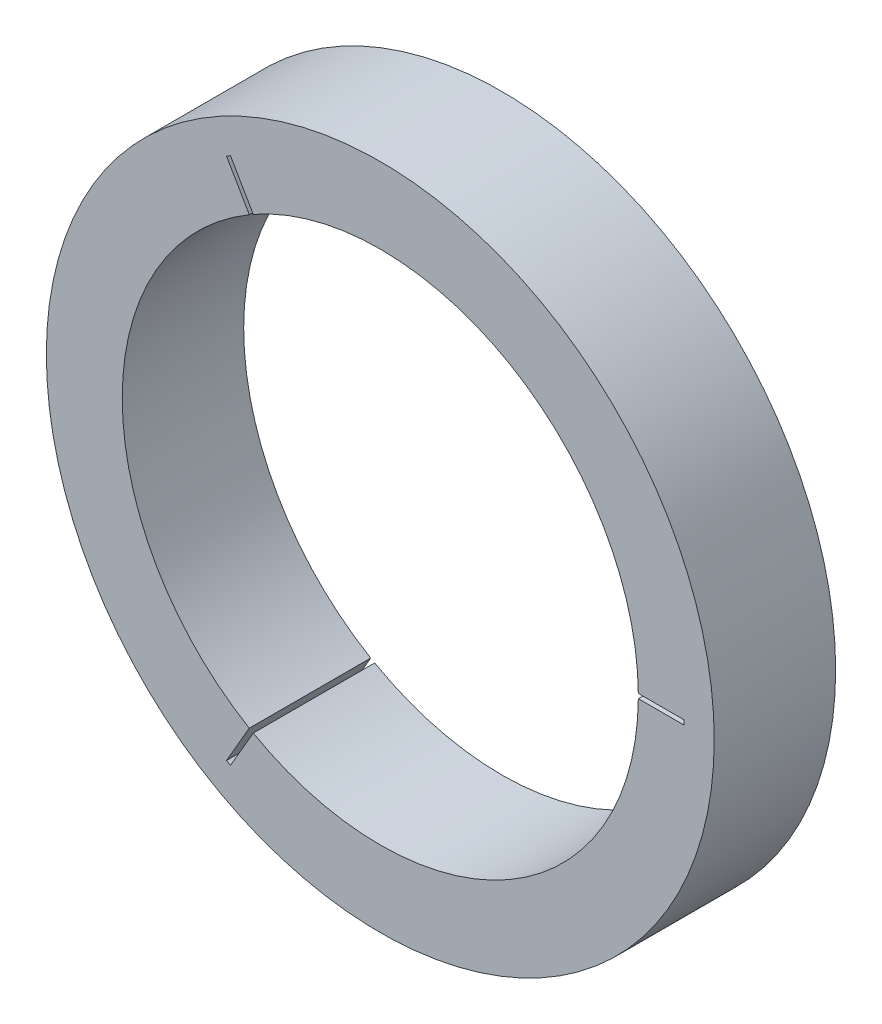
ISO-10303-21;
HEADER;
FILE_DESCRIPTION(('STEP AP214'),'2;1');
FILE_NAME('part.step','',(''),(''),'','','');
FILE_SCHEMA(('AUTOMOTIVE_DESIGN { 1 0 10303 214 1 1 1 1 }'));
ENDSEC;
DATA;
#1=APPLICATION_CONTEXT('core data for automotive mechanical design processes');
#2=APPLICATION_PROTOCOL_DEFINITION('international standard','automotive_design',2000,#1);
#3=PRODUCT_CONTEXT('',#1,'mechanical');
#4=PRODUCT('Part','Part','',(#3));
#5=PRODUCT_RELATED_PRODUCT_CATEGORY('part','',(#4));
#6=PRODUCT_DEFINITION_FORMATION('','',#4);
#7=PRODUCT_DEFINITION_CONTEXT('part definition',#1,'design');
#8=PRODUCT_DEFINITION('design','',#6,#7);
#9=PRODUCT_DEFINITION_SHAPE('','',#8);
#10=(LENGTH_UNIT() NAMED_UNIT(*) SI_UNIT(.MILLI.,.METRE.));
#11=(NAMED_UNIT(*) PLANE_ANGLE_UNIT() SI_UNIT($,.RADIAN.));
#12=(NAMED_UNIT(*) SI_UNIT($,.STERADIAN.) SOLID_ANGLE_UNIT());
#13=UNCERTAINTY_MEASURE_WITH_UNIT(LENGTH_MEASURE(1.E-05),#10,'distance_accuracy_value','');
#14=(GEOMETRIC_REPRESENTATION_CONTEXT(3) GLOBAL_UNCERTAINTY_ASSIGNED_CONTEXT((#13)) GLOBAL_UNIT_ASSIGNED_CONTEXT((#10,
#11,#12)) REPRESENTATION_CONTEXT('',''));
#15=CARTESIAN_POINT('',(0.,0.,0.));
#16=DIRECTION('',(0.,0.,1.));
#17=DIRECTION('',(1.,0.,0.));
#18=AXIS2_PLACEMENT_3D('',#15,#16,#17);
#19=CARTESIAN_POINT('',(0.,0.,0.));
#20=DIRECTION('',(0.,0.,1.));
#21=DIRECTION('',(1.,0.,0.));
#22=AXIS2_PLACEMENT_3D('',#19,#20,#21);
#23=CYLINDRICAL_SURFACE('',#22,85.);
#24=CARTESIAN_POINT('',(0.,0.,0.));
#25=DIRECTION('',(0.,0.,1.));
#26=DIRECTION('',(1.,0.,0.));
#27=AXIS2_PLACEMENT_3D('',#24,#25,#26);
#28=CIRCLE('',#27,85.);
#29=CARTESIAN_POINT('',(-43.1478646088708,73.2342937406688,0.));
#30=VERTEX_POINT('',#29);
#31=CARTESIAN_POINT('',(-43.1478646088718,-73.2342937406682,0.));
#32=VERTEX_POINT('',#31);
#33=EDGE_CURVE('E64',#30,#32,#28,.T.);
#34=ORIENTED_EDGE('',*,*,#33,.F.);
#35=DIRECTION('',(0.,0.,1.));
#36=VECTOR('',#35,1.);
#37=CARTESIAN_POINT('',(-43.1478646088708,73.2342937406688,0.));
#38=LINE('',#37,#36);
#39=CARTESIAN_POINT('',(-43.1478646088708,73.2342937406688,40.));
#40=VERTEX_POINT('',#39);
#41=EDGE_CURVE('E11',#30,#40,#38,.T.);
#42=ORIENTED_EDGE('',*,*,#41,.T.);
#43=CARTESIAN_POINT('',(0.,0.,40.));
#44=DIRECTION('',(0.,0.,1.));
#45=DIRECTION('',(1.,0.,0.));
#46=AXIS2_PLACEMENT_3D('',#43,#44,#45);
#47=CIRCLE('',#46,85.);
#48=CARTESIAN_POINT('',(-43.1478646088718,-73.2342937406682,40.));
#49=VERTEX_POINT('',#48);
#50=EDGE_CURVE('E206',#40,#49,#47,.T.);
#51=ORIENTED_EDGE('',*,*,#50,.T.);
#52=DIRECTION('',(0.,0.,1.));
#53=VECTOR('',#52,1.);
#54=CARTESIAN_POINT('',(-43.1478646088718,-73.2342937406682,0.));
#55=LINE('',#54,#53);
#56=EDGE_CURVE('E222',#49,#32,#55,.F.);
#57=ORIENTED_EDGE('',*,*,#56,.T.);
#58=EDGE_LOOP('',(#34,#42,#51,#57));
#59=FACE_BOUND('',#58,.T.);
#60=ADVANCED_FACE('F41',(#59),#23,.F.);
#61=CARTESIAN_POINT('',(-41.8488265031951,-73.9842937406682,0.));
#62=VERTEX_POINT('',#61);
#63=CARTESIAN_POINT('',(84.9966911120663,-0.750000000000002,0.));
#64=VERTEX_POINT('',#63);
#65=EDGE_CURVE('E205',#62,#64,#28,.T.);
#66=ORIENTED_EDGE('',*,*,#65,.F.);
#67=DIRECTION('',(0.,0.,1.));
#68=VECTOR('',#67,1.);
#69=CARTESIAN_POINT('',(-41.8488265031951,-73.9842937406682,0.));
#70=LINE('',#69,#68);
#71=CARTESIAN_POINT('',(-41.8488265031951,-73.9842937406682,40.));
#72=VERTEX_POINT('',#71);
#73=EDGE_CURVE('E225',#62,#72,#70,.T.);
#74=ORIENTED_EDGE('',*,*,#73,.T.);
#75=CARTESIAN_POINT('',(84.9966911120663,-0.750000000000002,40.));
#76=VERTEX_POINT('',#75);
#77=EDGE_CURVE('E200',#72,#76,#47,.T.);
#78=ORIENTED_EDGE('',*,*,#77,.T.);
#79=DIRECTION('',(0.,0.,1.));
#80=VECTOR('',#79,1.);
#81=CARTESIAN_POINT('',(84.9966911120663,-0.750000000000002,0.));
#82=LINE('',#81,#80);
#83=EDGE_CURVE('E216',#76,#64,#82,.F.);
#84=ORIENTED_EDGE('',*,*,#83,.T.);
#85=EDGE_LOOP('',(#66,#74,#78,#84));
#86=FACE_BOUND('',#85,.T.);
#87=ADVANCED_FACE('F248',(#86),#23,.F.);
#88=CARTESIAN_POINT('',(0.,0.,40.));
#89=DIRECTION('',(0.,0.,-1.));
#90=DIRECTION('',(-1.,0.,0.));
#91=AXIS2_PLACEMENT_3D('',#88,#89,#90);
#92=CYLINDRICAL_SURFACE('',#91,110.);
#93=CARTESIAN_POINT('',(0.,0.,40.));
#94=DIRECTION('',(0.,0.,1.));
#95=DIRECTION('',(1.,0.,0.));
#96=AXIS2_PLACEMENT_3D('',#93,#94,#95);
#97=CIRCLE('',#96,110.);
#98=CARTESIAN_POINT('',(110.,0.,40.));
#99=VERTEX_POINT('',#98);
#100=EDGE_CURVE('E213',#99,#99,#97,.T.);
#101=ORIENTED_EDGE('',*,*,#100,.F.);
#102=EDGE_LOOP('',(#101));
#103=FACE_BOUND('',#102,.T.);
#104=CARTESIAN_POINT('',(0.,0.,0.));
#105=DIRECTION('',(0.,0.,1.));
#106=DIRECTION('',(1.,0.,0.));
#107=AXIS2_PLACEMENT_3D('',#104,#105,#106);
#108=CIRCLE('',#107,110.);
#109=CARTESIAN_POINT('',(110.,0.,0.));
#110=VERTEX_POINT('',#109);
#111=EDGE_CURVE('E210',#110,#110,#108,.T.);
#112=ORIENTED_EDGE('',*,*,#111,.T.);
#113=EDGE_LOOP('',(#112));
#114=FACE_BOUND('',#113,.T.);
#115=ADVANCED_FACE('F43',(#103,#114),#92,.T.);
#116=CARTESIAN_POINT('',(0.,0.,40.));
#117=DIRECTION('',(0.,0.,1.));
#118=DIRECTION('',(1.,0.,0.));
#119=AXIS2_PLACEMENT_3D('',#116,#117,#118);
#120=PLANE('',#119);
#121=DIRECTION('',(0.499999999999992,-0.866025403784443,0.));
#122=VECTOR('',#121,1.);
#123=CARTESIAN_POINT('',(-50.6495190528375,86.2275403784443,40.));
#124=LINE('',#123,#122);
#125=CARTESIAN_POINT('',(-50.6495190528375,86.2275403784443,40.));
#126=VERTEX_POINT('',#125);
#127=EDGE_CURVE('E140',#126,#40,#124,.T.);
#128=ORIENTED_EDGE('',*,*,#127,.F.);
#129=DIRECTION('',(-0.866025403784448,-0.499999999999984,0.));
#130=VECTOR('',#129,1.);
#131=CARTESIAN_POINT('',(-49.3504809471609,86.9775403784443,40.));
#132=LINE('',#131,#130);
#133=CARTESIAN_POINT('',(-49.3504809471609,86.9775403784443,40.));
#134=VERTEX_POINT('',#133);
#135=EDGE_CURVE('E139',#134,#126,#132,.T.);
#136=ORIENTED_EDGE('',*,*,#135,.F.);
#137=DIRECTION('',(-0.499999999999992,0.866025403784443,0.));
#138=VECTOR('',#137,1.);
#139=CARTESIAN_POINT('',(-49.3504809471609,86.9775403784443,40.));
#140=LINE('',#139,#138);
#141=CARTESIAN_POINT('',(-41.8488265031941,73.9842937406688,40.));
#142=VERTEX_POINT('',#141);
#143=EDGE_CURVE('E130',#142,#134,#140,.T.);
#144=ORIENTED_EDGE('',*,*,#143,.F.);
#145=CARTESIAN_POINT('',(84.9966911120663,0.749999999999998,40.));
#146=VERTEX_POINT('',#145);
#147=EDGE_CURVE('E203',#146,#142,#47,.T.);
#148=ORIENTED_EDGE('',*,*,#147,.F.);
#149=DIRECTION('',(-1.,0.,0.));
#150=VECTOR('',#149,1.);
#151=CARTESIAN_POINT('',(100.,0.75,40.));
#152=LINE('',#151,#150);
#153=CARTESIAN_POINT('',(100.,0.75,40.));
#154=VERTEX_POINT('',#153);
#155=EDGE_CURVE('E179',#154,#146,#152,.T.);
#156=ORIENTED_EDGE('',*,*,#155,.F.);
#157=DIRECTION('',(0.,1.,0.));
#158=VECTOR('',#157,1.);
#159=CARTESIAN_POINT('',(100.,-0.75,40.));
#160=LINE('',#159,#158);
#161=CARTESIAN_POINT('',(100.,-0.75,40.));
#162=VERTEX_POINT('',#161);
#163=EDGE_CURVE('E185',#162,#154,#160,.T.);
#164=ORIENTED_EDGE('',*,*,#163,.F.);
#165=DIRECTION('',(1.,0.,0.));
#166=VECTOR('',#165,1.);
#167=CARTESIAN_POINT('',(100.,-0.75,40.));
#168=LINE('',#167,#166);
#169=EDGE_CURVE('E183',#76,#162,#168,.T.);
#170=ORIENTED_EDGE('',*,*,#169,.F.);
#171=ORIENTED_EDGE('',*,*,#77,.F.);
#172=DIRECTION('',(0.500000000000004,0.866025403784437,0.));
#173=VECTOR('',#172,1.);
#174=CARTESIAN_POINT('',(-49.3504809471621,-86.9775403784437,40.));
#175=LINE('',#174,#173);
#176=CARTESIAN_POINT('',(-49.3504809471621,-86.9775403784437,40.));
#177=VERTEX_POINT('',#176);
#178=EDGE_CURVE('E160',#177,#72,#175,.T.);
#179=ORIENTED_EDGE('',*,*,#178,.F.);
#180=DIRECTION('',(0.866025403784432,-0.500000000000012,0.));
#181=VECTOR('',#180,1.);
#182=CARTESIAN_POINT('',(-50.6495190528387,-86.2275403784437,40.));
#183=LINE('',#182,#181);
#184=CARTESIAN_POINT('',(-50.6495190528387,-86.2275403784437,40.));
#185=VERTEX_POINT('',#184);
#186=EDGE_CURVE('E165',#185,#177,#183,.T.);
#187=ORIENTED_EDGE('',*,*,#186,.F.);
#188=DIRECTION('',(-0.500000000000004,-0.866025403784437,0.));
#189=VECTOR('',#188,1.);
#190=CARTESIAN_POINT('',(-50.6495190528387,-86.2275403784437,40.));
#191=LINE('',#190,#189);
#192=EDGE_CURVE('E163',#49,#185,#191,.T.);
#193=ORIENTED_EDGE('',*,*,#192,.F.);
#194=ORIENTED_EDGE('',*,*,#50,.F.);
#195=EDGE_LOOP('',(#128,#136,#144,#148,#156,#164,#170,#171,#179,#187,#193,#194));
#196=FACE_BOUND('',#195,.T.);
#197=ORIENTED_EDGE('',*,*,#100,.T.);
#198=EDGE_LOOP('',(#197));
#199=FACE_BOUND('',#198,.T.);
#200=ADVANCED_FACE('F150',(#196,#199),#120,.T.);
#201=CARTESIAN_POINT('',(0.,0.,0.));
#202=DIRECTION('',(0.,0.,1.));
#203=DIRECTION('',(1.,0.,0.));
#204=AXIS2_PLACEMENT_3D('',#201,#202,#203);
#205=PLANE('',#204);
#206=DIRECTION('',(-0.866025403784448,-0.499999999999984,0.));
#207=VECTOR('',#206,1.);
#208=CARTESIAN_POINT('',(-49.3504809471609,86.9775403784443,0.));
#209=LINE('',#208,#207);
#210=CARTESIAN_POINT('',(-49.3504809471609,86.9775403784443,0.));
#211=VERTEX_POINT('',#210);
#212=CARTESIAN_POINT('',(-50.6495190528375,86.2275403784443,0.));
#213=VERTEX_POINT('',#212);
#214=EDGE_CURVE('E147',#211,#213,#209,.T.);
#215=ORIENTED_EDGE('',*,*,#214,.T.);
#216=DIRECTION('',(0.499999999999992,-0.866025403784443,0.));
#217=VECTOR('',#216,1.);
#218=CARTESIAN_POINT('',(-50.6495190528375,86.2275403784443,0.));
#219=LINE('',#218,#217);
#220=EDGE_CURVE('E153',#213,#30,#219,.T.);
#221=ORIENTED_EDGE('',*,*,#220,.T.);
#222=ORIENTED_EDGE('',*,*,#33,.T.);
#223=DIRECTION('',(-0.500000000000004,-0.866025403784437,0.));
#224=VECTOR('',#223,1.);
#225=CARTESIAN_POINT('',(-50.6495190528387,-86.2275403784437,0.));
#226=LINE('',#225,#224);
#227=CARTESIAN_POINT('',(-50.6495190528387,-86.2275403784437,0.));
#228=VERTEX_POINT('',#227);
#229=EDGE_CURVE('E171',#32,#228,#226,.T.);
#230=ORIENTED_EDGE('',*,*,#229,.T.);
#231=DIRECTION('',(0.866025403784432,-0.500000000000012,0.));
#232=VECTOR('',#231,1.);
#233=CARTESIAN_POINT('',(-50.6495190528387,-86.2275403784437,0.));
#234=LINE('',#233,#232);
#235=CARTESIAN_POINT('',(-49.3504809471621,-86.9775403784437,0.));
#236=VERTEX_POINT('',#235);
#237=EDGE_CURVE('E173',#228,#236,#234,.T.);
#238=ORIENTED_EDGE('',*,*,#237,.T.);
#239=DIRECTION('',(0.500000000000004,0.866025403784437,0.));
#240=VECTOR('',#239,1.);
#241=CARTESIAN_POINT('',(-49.3504809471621,-86.9775403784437,0.));
#242=LINE('',#241,#240);
#243=EDGE_CURVE('E168',#236,#62,#242,.T.);
#244=ORIENTED_EDGE('',*,*,#243,.T.);
#245=ORIENTED_EDGE('',*,*,#65,.T.);
#246=DIRECTION('',(1.,0.,0.));
#247=VECTOR('',#246,1.);
#248=CARTESIAN_POINT('',(100.,-0.75,0.));
#249=LINE('',#248,#247);
#250=CARTESIAN_POINT('',(100.,-0.75,0.));
#251=VERTEX_POINT('',#250);
#252=EDGE_CURVE('E191',#64,#251,#249,.T.);
#253=ORIENTED_EDGE('',*,*,#252,.T.);
#254=DIRECTION('',(0.,1.,0.));
#255=VECTOR('',#254,1.);
#256=CARTESIAN_POINT('',(100.,-0.75,0.));
#257=LINE('',#256,#255);
#258=CARTESIAN_POINT('',(100.,0.75,0.));
#259=VERTEX_POINT('',#258);
#260=EDGE_CURVE('E194',#251,#259,#257,.T.);
#261=ORIENTED_EDGE('',*,*,#260,.T.);
#262=DIRECTION('',(-1.,0.,0.));
#263=VECTOR('',#262,1.);
#264=CARTESIAN_POINT('',(100.,0.75,0.));
#265=LINE('',#264,#263);
#266=CARTESIAN_POINT('',(84.9966911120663,0.749999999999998,0.));
#267=VERTEX_POINT('',#266);
#268=EDGE_CURVE('E188',#259,#267,#265,.T.);
#269=ORIENTED_EDGE('',*,*,#268,.T.);
#270=CARTESIAN_POINT('',(-41.8488265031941,73.9842937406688,0.));
#271=VERTEX_POINT('',#270);
#272=EDGE_CURVE('E207',#267,#271,#28,.T.);
#273=ORIENTED_EDGE('',*,*,#272,.T.);
#274=DIRECTION('',(-0.499999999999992,0.866025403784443,0.));
#275=VECTOR('',#274,1.);
#276=CARTESIAN_POINT('',(-49.3504809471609,86.9775403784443,0.));
#277=LINE('',#276,#275);
#278=EDGE_CURVE('E56',#271,#211,#277,.T.);
#279=ORIENTED_EDGE('',*,*,#278,.T.);
#280=EDGE_LOOP('',(#215,#221,#222,#230,#238,#244,#245,#253,#261,#269,#273,#279));
#281=FACE_BOUND('',#280,.T.);
#282=ORIENTED_EDGE('',*,*,#111,.F.);
#283=EDGE_LOOP('',(#282));
#284=FACE_BOUND('',#283,.T.);
#285=ADVANCED_FACE('F230',(#281,#284),#205,.F.);
#286=ORIENTED_EDGE('',*,*,#147,.T.);
#287=DIRECTION('',(0.,0.,1.));
#288=VECTOR('',#287,1.);
#289=CARTESIAN_POINT('',(-41.8488265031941,73.9842937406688,0.));
#290=LINE('',#289,#288);
#291=EDGE_CURVE('E49',#142,#271,#290,.F.);
#292=ORIENTED_EDGE('',*,*,#291,.T.);
#293=ORIENTED_EDGE('',*,*,#272,.F.);
#294=DIRECTION('',(0.,0.,1.));
#295=VECTOR('',#294,1.);
#296=CARTESIAN_POINT('',(84.9966911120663,0.749999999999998,0.));
#297=LINE('',#296,#295);
#298=EDGE_CURVE('E219',#267,#146,#297,.T.);
#299=ORIENTED_EDGE('',*,*,#298,.T.);
#300=EDGE_LOOP('',(#286,#292,#293,#299));
#301=FACE_BOUND('',#300,.T.);
#302=ADVANCED_FACE('F229',(#301),#23,.F.);
#303=CARTESIAN_POINT('',(100.,0.75,0.));
#304=DIRECTION('',(0.,1.,0.));
#305=DIRECTION('',(-1.,0.,0.));
#306=AXIS2_PLACEMENT_3D('',#303,#304,#305);
#307=PLANE('',#306);
#308=ORIENTED_EDGE('',*,*,#268,.F.);
#309=DIRECTION('',(0.,0.,1.));
#310=VECTOR('',#309,1.);
#311=CARTESIAN_POINT('',(100.,0.75,0.));
#312=LINE('',#311,#310);
#313=EDGE_CURVE('E198',#259,#154,#312,.T.);
#314=ORIENTED_EDGE('',*,*,#313,.T.);
#315=ORIENTED_EDGE('',*,*,#155,.T.);
#316=ORIENTED_EDGE('',*,*,#298,.F.);
#317=EDGE_LOOP('',(#308,#314,#315,#316));
#318=FACE_BOUND('',#317,.T.);
#319=ADVANCED_FACE('F235',(#318),#307,.F.);
#320=CARTESIAN_POINT('',(100.,-0.75,0.));
#321=DIRECTION('',(0.,-1.,0.));
#322=DIRECTION('',(1.,0.,0.));
#323=AXIS2_PLACEMENT_3D('',#320,#321,#322);
#324=PLANE('',#323);
#325=ORIENTED_EDGE('',*,*,#169,.T.);
#326=DIRECTION('',(0.,0.,1.));
#327=VECTOR('',#326,1.);
#328=CARTESIAN_POINT('',(100.,-0.75,0.));
#329=LINE('',#328,#327);
#330=EDGE_CURVE('E197',#251,#162,#329,.T.);
#331=ORIENTED_EDGE('',*,*,#330,.F.);
#332=ORIENTED_EDGE('',*,*,#252,.F.);
#333=ORIENTED_EDGE('',*,*,#83,.F.);
#334=EDGE_LOOP('',(#325,#331,#332,#333));
#335=FACE_BOUND('',#334,.T.);
#336=ADVANCED_FACE('F244',(#335),#324,.F.);
#337=CARTESIAN_POINT('',(100.,-0.75,0.));
#338=DIRECTION('',(1.,0.,0.));
#339=DIRECTION('',(0.,1.,0.));
#340=AXIS2_PLACEMENT_3D('',#337,#338,#339);
#341=PLANE('',#340);
#342=ORIENTED_EDGE('',*,*,#163,.T.);
#343=ORIENTED_EDGE('',*,*,#313,.F.);
#344=ORIENTED_EDGE('',*,*,#260,.F.);
#345=ORIENTED_EDGE('',*,*,#330,.T.);
#346=EDGE_LOOP('',(#342,#343,#344,#345));
#347=FACE_BOUND('',#346,.T.);
#348=ADVANCED_FACE('F241',(#347),#341,.F.);
#349=CARTESIAN_POINT('',(-49.3504809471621,-86.9775403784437,0.));
#350=DIRECTION('',(0.866025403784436,-0.500000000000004,0.));
#351=DIRECTION('',(0.500000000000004,0.866025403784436,0.));
#352=AXIS2_PLACEMENT_3D('',#349,#350,#351);
#353=PLANE('',#352);
#354=ORIENTED_EDGE('',*,*,#243,.F.);
#355=DIRECTION('',(0.,0.,1.));
#356=VECTOR('',#355,1.);
#357=CARTESIAN_POINT('',(-49.3504809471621,-86.9775403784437,0.));
#358=LINE('',#357,#356);
#359=EDGE_CURVE('E177',#236,#177,#358,.T.);
#360=ORIENTED_EDGE('',*,*,#359,.T.);
#361=ORIENTED_EDGE('',*,*,#178,.T.);
#362=ORIENTED_EDGE('',*,*,#73,.F.);
#363=EDGE_LOOP('',(#354,#360,#361,#362));
#364=FACE_BOUND('',#363,.T.);
#365=ADVANCED_FACE('F261',(#364),#353,.F.);
#366=CARTESIAN_POINT('',(-50.6495190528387,-86.2275403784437,0.));
#367=DIRECTION('',(-0.866025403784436,0.500000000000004,0.));
#368=DIRECTION('',(-0.500000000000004,-0.866025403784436,0.));
#369=AXIS2_PLACEMENT_3D('',#366,#367,#368);
#370=PLANE('',#369);
#371=ORIENTED_EDGE('',*,*,#192,.T.);
#372=DIRECTION('',(0.,0.,1.));
#373=VECTOR('',#372,1.);
#374=CARTESIAN_POINT('',(-50.6495190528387,-86.2275403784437,0.));
#375=LINE('',#374,#373);
#376=EDGE_CURVE('E176',#228,#185,#375,.T.);
#377=ORIENTED_EDGE('',*,*,#376,.F.);
#378=ORIENTED_EDGE('',*,*,#229,.F.);
#379=ORIENTED_EDGE('',*,*,#56,.F.);
#380=EDGE_LOOP('',(#371,#377,#378,#379));
#381=FACE_BOUND('',#380,.T.);
#382=ADVANCED_FACE('F254',(#381),#370,.F.);
#383=CARTESIAN_POINT('',(-50.6495190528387,-86.2275403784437,0.));
#384=DIRECTION('',(-0.500000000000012,-0.866025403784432,0.));
#385=DIRECTION('',(0.866025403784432,-0.500000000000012,0.));
#386=AXIS2_PLACEMENT_3D('',#383,#384,#385);
#387=PLANE('',#386);
#388=ORIENTED_EDGE('',*,*,#186,.T.);
#389=ORIENTED_EDGE('',*,*,#359,.F.);
#390=ORIENTED_EDGE('',*,*,#237,.F.);
#391=ORIENTED_EDGE('',*,*,#376,.T.);
#392=EDGE_LOOP('',(#388,#389,#390,#391));
#393=FACE_BOUND('',#392,.T.);
#394=ADVANCED_FACE('F257',(#393),#387,.F.);
#395=CARTESIAN_POINT('',(-50.6495190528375,86.2275403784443,0.));
#396=DIRECTION('',(-0.866025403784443,-0.499999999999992,0.));
#397=DIRECTION('',(0.499999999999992,-0.866025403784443,0.));
#398=AXIS2_PLACEMENT_3D('',#395,#396,#397);
#399=PLANE('',#398);
#400=ORIENTED_EDGE('',*,*,#220,.F.);
#401=DIRECTION('',(0.,0.,1.));
#402=VECTOR('',#401,1.);
#403=CARTESIAN_POINT('',(-50.6495190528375,86.2275403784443,0.));
#404=LINE('',#403,#402);
#405=EDGE_CURVE('E148',#213,#126,#404,.T.);
#406=ORIENTED_EDGE('',*,*,#405,.T.);
#407=ORIENTED_EDGE('',*,*,#127,.T.);
#408=ORIENTED_EDGE('',*,*,#41,.F.);
#409=EDGE_LOOP('',(#400,#406,#407,#408));
#410=FACE_BOUND('',#409,.T.);
#411=ADVANCED_FACE('F335',(#410),#399,.F.);
#412=CARTESIAN_POINT('',(-49.3504809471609,86.9775403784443,0.));
#413=DIRECTION('',(0.866025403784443,0.499999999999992,0.));
#414=DIRECTION('',(-0.499999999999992,0.866025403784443,0.));
#415=AXIS2_PLACEMENT_3D('',#412,#413,#414);
#416=PLANE('',#415);
#417=ORIENTED_EDGE('',*,*,#143,.T.);
#418=DIRECTION('',(0.,0.,1.));
#419=VECTOR('',#418,1.);
#420=CARTESIAN_POINT('',(-49.3504809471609,86.9775403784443,0.));
#421=LINE('',#420,#419);
#422=EDGE_CURVE('E133',#211,#134,#421,.T.);
#423=ORIENTED_EDGE('',*,*,#422,.F.);
#424=ORIENTED_EDGE('',*,*,#278,.F.);
#425=ORIENTED_EDGE('',*,*,#291,.F.);
#426=EDGE_LOOP('',(#417,#423,#424,#425));
#427=FACE_BOUND('',#426,.T.);
#428=ADVANCED_FACE('F132',(#427),#416,.F.);
#429=CARTESIAN_POINT('',(-49.3504809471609,86.9775403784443,0.));
#430=DIRECTION('',(-0.499999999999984,0.866025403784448,0.));
#431=DIRECTION('',(-0.866025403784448,-0.499999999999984,0.));
#432=AXIS2_PLACEMENT_3D('',#429,#430,#431);
#433=PLANE('',#432);
#434=ORIENTED_EDGE('',*,*,#135,.T.);
#435=ORIENTED_EDGE('',*,*,#405,.F.);
#436=ORIENTED_EDGE('',*,*,#214,.F.);
#437=ORIENTED_EDGE('',*,*,#422,.T.);
#438=EDGE_LOOP('',(#434,#435,#436,#437));
#439=FACE_BOUND('',#438,.T.);
#440=ADVANCED_FACE('F144',(#439),#433,.F.);
#441=CLOSED_SHELL('',(#60,#87,#115,#200,#285,#302,#319,#336,#348,#365,#382,#394,#411,#428,#440));
#442=MANIFOLD_SOLID_BREP('B2',#441);
#443=ADVANCED_BREP_SHAPE_REPRESENTATION('',(#18,#442),#14);
#444=SHAPE_DEFINITION_REPRESENTATION(#9,#443);
ENDSEC;
END-ISO-10303-21;
